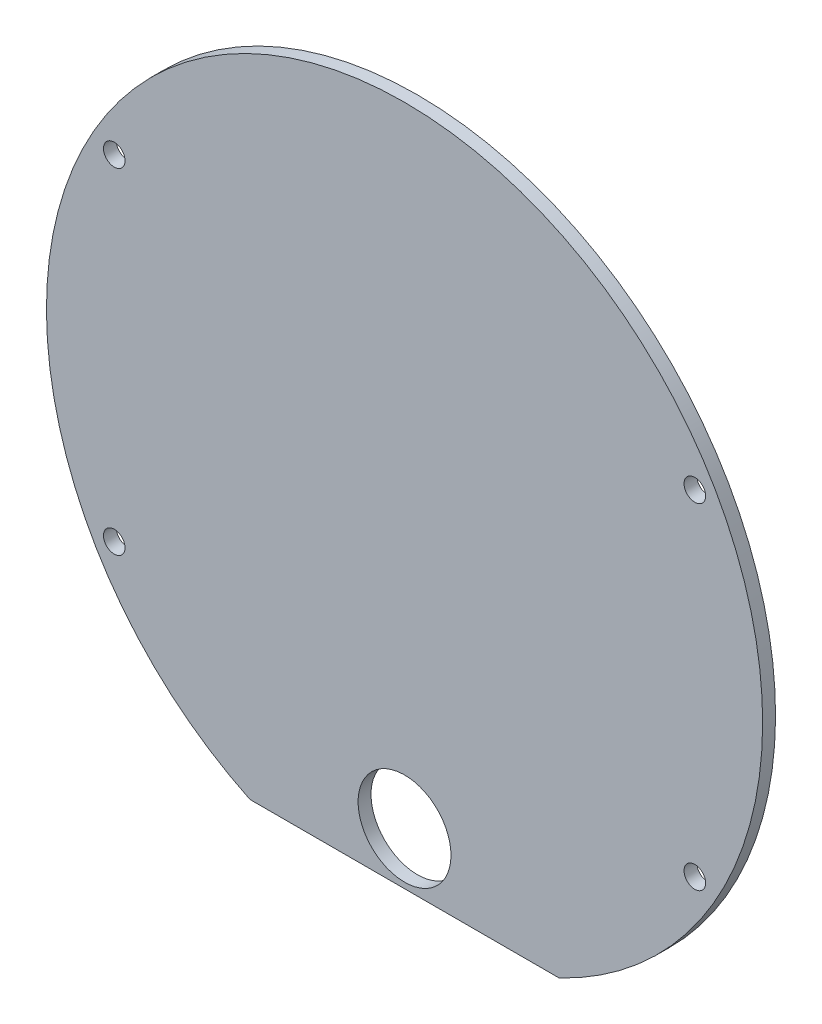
ISO-10303-21;
HEADER;
FILE_DESCRIPTION(('STEP AP214'),'2;1');
FILE_NAME('part.step','',(''),(''),'','','');
FILE_SCHEMA(('AUTOMOTIVE_DESIGN { 1 0 10303 214 1 1 1 1 }'));
ENDSEC;
DATA;
#1=APPLICATION_CONTEXT('core data for automotive mechanical design processes');
#2=APPLICATION_PROTOCOL_DEFINITION('international standard','automotive_design',2000,#1);
#3=PRODUCT_CONTEXT('',#1,'mechanical');
#4=PRODUCT('Part','Part','',(#3));
#5=PRODUCT_RELATED_PRODUCT_CATEGORY('part','',(#4));
#6=PRODUCT_DEFINITION_FORMATION('','',#4);
#7=PRODUCT_DEFINITION_CONTEXT('part definition',#1,'design');
#8=PRODUCT_DEFINITION('design','',#6,#7);
#9=PRODUCT_DEFINITION_SHAPE('','',#8);
#10=(LENGTH_UNIT() NAMED_UNIT(*) SI_UNIT(.MILLI.,.METRE.));
#11=(NAMED_UNIT(*) PLANE_ANGLE_UNIT() SI_UNIT($,.RADIAN.));
#12=(NAMED_UNIT(*) SI_UNIT($,.STERADIAN.) SOLID_ANGLE_UNIT());
#13=UNCERTAINTY_MEASURE_WITH_UNIT(LENGTH_MEASURE(1.E-05),#10,'distance_accuracy_value','');
#14=(GEOMETRIC_REPRESENTATION_CONTEXT(3) GLOBAL_UNCERTAINTY_ASSIGNED_CONTEXT((#13)) GLOBAL_UNIT_ASSIGNED_CONTEXT((#10,
#11,#12)) REPRESENTATION_CONTEXT('',''));
#15=CARTESIAN_POINT('',(0.,0.,0.));
#16=DIRECTION('',(0.,0.,1.));
#17=DIRECTION('',(1.,0.,0.));
#18=AXIS2_PLACEMENT_3D('',#15,#16,#17);
#19=CARTESIAN_POINT('',(0.,0.,3.175));
#20=DIRECTION('',(0.,0.,-1.));
#21=DIRECTION('',(-1.,0.,0.));
#22=AXIS2_PLACEMENT_3D('',#19,#20,#21);
#23=PLANE('',#22);
#24=CARTESIAN_POINT('',(0.,0.,3.175));
#25=DIRECTION('',(0.,0.,-1.));
#26=DIRECTION('',(-1.,0.,0.));
#27=AXIS2_PLACEMENT_3D('',#24,#25,#26);
#28=CIRCLE('',#27,88.138);
#29=CARTESIAN_POINT('',(-38.0491660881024,-79.502,3.175));
#30=VERTEX_POINT('',#29);
#31=CARTESIAN_POINT('',(38.0491660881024,-79.502,3.175));
#32=VERTEX_POINT('',#31);
#33=EDGE_CURVE('E41',#30,#32,#28,.T.);
#34=ORIENTED_EDGE('',*,*,#33,.F.);
#35=DIRECTION('',(1.,0.,0.));
#36=VECTOR('',#35,1.);
#37=CARTESIAN_POINT('',(-38.0491660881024,-79.502,3.175));
#38=LINE('',#37,#36);
#39=EDGE_CURVE('E50',#30,#32,#38,.T.);
#40=ORIENTED_EDGE('',*,*,#39,.T.);
#41=EDGE_LOOP('',(#34,#40));
#42=FACE_BOUND('',#41,.T.);
#43=CARTESIAN_POINT('',(71.4464029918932,-41.2495999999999,3.175));
#44=DIRECTION('',(0.,0.,1.));
#45=DIRECTION('',(1.,0.,0.));
#46=AXIS2_PLACEMENT_3D('',#43,#44,#45);
#47=CIRCLE('',#46,2.6543);
#48=CARTESIAN_POINT('',(74.1007029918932,-41.2495999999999,3.175));
#49=VERTEX_POINT('',#48);
#50=EDGE_CURVE('E53',#49,#49,#47,.F.);
#51=ORIENTED_EDGE('',*,*,#50,.T.);
#52=EDGE_LOOP('',(#51));
#53=FACE_BOUND('',#52,.T.);
#54=CARTESIAN_POINT('',(71.4464029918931,41.2496000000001,3.175));
#55=DIRECTION('',(0.,0.,1.));
#56=DIRECTION('',(1.,0.,0.));
#57=AXIS2_PLACEMENT_3D('',#54,#55,#56);
#58=CIRCLE('',#57,2.6543);
#59=CARTESIAN_POINT('',(74.1007029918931,41.2496000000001,3.175));
#60=VERTEX_POINT('',#59);
#61=EDGE_CURVE('E76',#60,#60,#58,.F.);
#62=ORIENTED_EDGE('',*,*,#61,.T.);
#63=EDGE_LOOP('',(#62));
#64=FACE_BOUND('',#63,.T.);
#65=CARTESIAN_POINT('',(-71.4464029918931,41.2496000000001,3.175));
#66=DIRECTION('',(0.,0.,1.));
#67=DIRECTION('',(1.,0.,0.));
#68=AXIS2_PLACEMENT_3D('',#65,#66,#67);
#69=CIRCLE('',#68,2.6543);
#70=CARTESIAN_POINT('',(-68.7921029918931,41.2496000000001,3.175));
#71=VERTEX_POINT('',#70);
#72=EDGE_CURVE('E79',#71,#71,#69,.F.);
#73=ORIENTED_EDGE('',*,*,#72,.T.);
#74=EDGE_LOOP('',(#73));
#75=FACE_BOUND('',#74,.T.);
#76=CARTESIAN_POINT('',(-71.4464029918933,-41.2495999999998,3.175));
#77=DIRECTION('',(0.,0.,1.));
#78=DIRECTION('',(1.,0.,0.));
#79=AXIS2_PLACEMENT_3D('',#76,#77,#78);
#80=CIRCLE('',#79,2.6543);
#81=CARTESIAN_POINT('',(-68.7921029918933,-41.2495999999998,3.175));
#82=VERTEX_POINT('',#81);
#83=EDGE_CURVE('E81',#82,#82,#80,.F.);
#84=ORIENTED_EDGE('',*,*,#83,.T.);
#85=EDGE_LOOP('',(#84));
#86=FACE_BOUND('',#85,.T.);
#87=CARTESIAN_POINT('',(0.,-66.675,3.175));
#88=DIRECTION('',(0.,0.,1.));
#89=DIRECTION('',(1.,0.,0.));
#90=AXIS2_PLACEMENT_3D('',#87,#88,#89);
#91=CIRCLE('',#90,11.43);
#92=CARTESIAN_POINT('',(11.43,-66.675,3.175));
#93=VERTEX_POINT('',#92);
#94=EDGE_CURVE('E19',#93,#93,#91,.F.);
#95=ORIENTED_EDGE('',*,*,#94,.T.);
#96=EDGE_LOOP('',(#95));
#97=FACE_BOUND('',#96,.T.);
#98=ADVANCED_FACE('F16',(#42,#53,#64,#75,#86,#97),#23,.F.);
#99=CARTESIAN_POINT('',(0.,-66.675,-0.00100000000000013));
#100=DIRECTION('',(0.,0.,1.));
#101=DIRECTION('',(1.,0.,0.));
#102=AXIS2_PLACEMENT_3D('',#99,#100,#101);
#103=CYLINDRICAL_SURFACE('',#102,11.43);
#104=ORIENTED_EDGE('',*,*,#94,.F.);
#105=EDGE_LOOP('',(#104));
#106=FACE_BOUND('',#105,.T.);
#107=CARTESIAN_POINT('',(0.,-66.675,0.));
#108=DIRECTION('',(0.,0.,1.));
#109=DIRECTION('',(1.,0.,0.));
#110=AXIS2_PLACEMENT_3D('',#107,#108,#109);
#111=CIRCLE('',#110,11.43);
#112=CARTESIAN_POINT('',(11.43,-66.675,0.));
#113=VERTEX_POINT('',#112);
#114=EDGE_CURVE('E48',#113,#113,#111,.T.);
#115=ORIENTED_EDGE('',*,*,#114,.F.);
#116=EDGE_LOOP('',(#115));
#117=FACE_BOUND('',#116,.T.);
#118=ADVANCED_FACE('F89',(#106,#117),#103,.F.);
#119=CARTESIAN_POINT('',(-71.4464029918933,-41.2495999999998,3.175));
#120=DIRECTION('',(0.,0.,1.));
#121=DIRECTION('',(1.,0.,0.));
#122=AXIS2_PLACEMENT_3D('',#119,#120,#121);
#123=CYLINDRICAL_SURFACE('',#122,2.6543);
#124=CARTESIAN_POINT('',(-71.4464029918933,-41.2495999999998,0.));
#125=DIRECTION('',(0.,0.,1.));
#126=DIRECTION('',(1.,0.,0.));
#127=AXIS2_PLACEMENT_3D('',#124,#125,#126);
#128=CIRCLE('',#127,2.6543);
#129=CARTESIAN_POINT('',(-68.7921029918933,-41.2495999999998,0.));
#130=VERTEX_POINT('',#129);
#131=EDGE_CURVE('E69',#130,#130,#128,.T.);
#132=ORIENTED_EDGE('',*,*,#131,.F.);
#133=EDGE_LOOP('',(#132));
#134=FACE_BOUND('',#133,.T.);
#135=ORIENTED_EDGE('',*,*,#83,.F.);
#136=EDGE_LOOP('',(#135));
#137=FACE_BOUND('',#136,.T.);
#138=ADVANCED_FACE('F92',(#134,#137),#123,.F.);
#139=CARTESIAN_POINT('',(-71.4464029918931,41.2496000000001,3.175));
#140=DIRECTION('',(0.,0.,1.));
#141=DIRECTION('',(1.,0.,0.));
#142=AXIS2_PLACEMENT_3D('',#139,#140,#141);
#143=CYLINDRICAL_SURFACE('',#142,2.6543);
#144=CARTESIAN_POINT('',(-71.4464029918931,41.2496000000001,0.));
#145=DIRECTION('',(0.,0.,1.));
#146=DIRECTION('',(1.,0.,0.));
#147=AXIS2_PLACEMENT_3D('',#144,#145,#146);
#148=CIRCLE('',#147,2.6543);
#149=CARTESIAN_POINT('',(-68.7921029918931,41.2496000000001,0.));
#150=VERTEX_POINT('',#149);
#151=EDGE_CURVE('E66',#150,#150,#148,.T.);
#152=ORIENTED_EDGE('',*,*,#151,.F.);
#153=EDGE_LOOP('',(#152));
#154=FACE_BOUND('',#153,.T.);
#155=ORIENTED_EDGE('',*,*,#72,.F.);
#156=EDGE_LOOP('',(#155));
#157=FACE_BOUND('',#156,.T.);
#158=ADVANCED_FACE('F115',(#154,#157),#143,.F.);
#159=CARTESIAN_POINT('',(71.4464029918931,41.2496000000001,3.175));
#160=DIRECTION('',(0.,0.,1.));
#161=DIRECTION('',(1.,0.,0.));
#162=AXIS2_PLACEMENT_3D('',#159,#160,#161);
#163=CYLINDRICAL_SURFACE('',#162,2.6543);
#164=CARTESIAN_POINT('',(71.4464029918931,41.2496000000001,0.));
#165=DIRECTION('',(0.,0.,1.));
#166=DIRECTION('',(1.,0.,0.));
#167=AXIS2_PLACEMENT_3D('',#164,#165,#166);
#168=CIRCLE('',#167,2.6543);
#169=CARTESIAN_POINT('',(74.1007029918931,41.2496000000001,0.));
#170=VERTEX_POINT('',#169);
#171=EDGE_CURVE('E63',#170,#170,#168,.T.);
#172=ORIENTED_EDGE('',*,*,#171,.F.);
#173=EDGE_LOOP('',(#172));
#174=FACE_BOUND('',#173,.T.);
#175=ORIENTED_EDGE('',*,*,#61,.F.);
#176=EDGE_LOOP('',(#175));
#177=FACE_BOUND('',#176,.T.);
#178=ADVANCED_FACE('F111',(#174,#177),#163,.F.);
#179=CARTESIAN_POINT('',(71.4464029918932,-41.2495999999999,3.175));
#180=DIRECTION('',(0.,0.,1.));
#181=DIRECTION('',(1.,0.,0.));
#182=AXIS2_PLACEMENT_3D('',#179,#180,#181);
#183=CYLINDRICAL_SURFACE('',#182,2.6543);
#184=CARTESIAN_POINT('',(71.4464029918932,-41.2495999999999,0.));
#185=DIRECTION('',(0.,0.,1.));
#186=DIRECTION('',(1.,0.,0.));
#187=AXIS2_PLACEMENT_3D('',#184,#185,#186);
#188=CIRCLE('',#187,2.6543);
#189=CARTESIAN_POINT('',(74.1007029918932,-41.2495999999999,0.));
#190=VERTEX_POINT('',#189);
#191=EDGE_CURVE('E60',#190,#190,#188,.T.);
#192=ORIENTED_EDGE('',*,*,#191,.F.);
#193=EDGE_LOOP('',(#192));
#194=FACE_BOUND('',#193,.T.);
#195=ORIENTED_EDGE('',*,*,#50,.F.);
#196=EDGE_LOOP('',(#195));
#197=FACE_BOUND('',#196,.T.);
#198=ADVANCED_FACE('F108',(#194,#197),#183,.F.);
#199=CARTESIAN_POINT('',(-38.0491660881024,-79.502,3.175));
#200=DIRECTION('',(0.,1.,0.));
#201=DIRECTION('',(0.,0.,1.));
#202=AXIS2_PLACEMENT_3D('',#199,#200,#201);
#203=PLANE('',#202);
#204=DIRECTION('',(0.,0.,1.));
#205=VECTOR('',#204,1.);
#206=CARTESIAN_POINT('',(38.0491660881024,-79.502,3.175));
#207=LINE('',#206,#205);
#208=CARTESIAN_POINT('',(38.0491660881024,-79.502,0.));
#209=VERTEX_POINT('',#208);
#210=EDGE_CURVE('E45',#32,#209,#207,.F.);
#211=ORIENTED_EDGE('',*,*,#210,.F.);
#212=ORIENTED_EDGE('',*,*,#39,.F.);
#213=DIRECTION('',(0.,0.,-1.));
#214=VECTOR('',#213,1.);
#215=CARTESIAN_POINT('',(-38.0491660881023,-79.502,3.175));
#216=LINE('',#215,#214);
#217=CARTESIAN_POINT('',(-38.0491660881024,-79.502,0.));
#218=VERTEX_POINT('',#217);
#219=EDGE_CURVE('E47',#218,#30,#216,.F.);
#220=ORIENTED_EDGE('',*,*,#219,.F.);
#221=DIRECTION('',(-1.,0.,0.));
#222=VECTOR('',#221,1.);
#223=CARTESIAN_POINT('',(0.,-79.502,0.));
#224=LINE('',#223,#222);
#225=EDGE_CURVE('E11',#209,#218,#224,.T.);
#226=ORIENTED_EDGE('',*,*,#225,.F.);
#227=EDGE_LOOP('',(#211,#212,#220,#226));
#228=FACE_BOUND('',#227,.T.);
#229=ADVANCED_FACE('F55',(#228),#203,.F.);
#230=CARTESIAN_POINT('',(0.,0.,3.175));
#231=DIRECTION('',(0.,0.,-1.));
#232=DIRECTION('',(-1.,0.,0.));
#233=AXIS2_PLACEMENT_3D('',#230,#231,#232);
#234=CYLINDRICAL_SURFACE('',#233,88.138);
#235=CARTESIAN_POINT('',(0.,0.,0.));
#236=DIRECTION('',(0.,0.,-1.));
#237=DIRECTION('',(-1.,0.,0.));
#238=AXIS2_PLACEMENT_3D('',#235,#236,#237);
#239=CIRCLE('',#238,88.138);
#240=EDGE_CURVE('E25',#218,#209,#239,.T.);
#241=ORIENTED_EDGE('',*,*,#240,.F.);
#242=ORIENTED_EDGE('',*,*,#219,.T.);
#243=ORIENTED_EDGE('',*,*,#33,.T.);
#244=ORIENTED_EDGE('',*,*,#210,.T.);
#245=EDGE_LOOP('',(#241,#242,#243,#244));
#246=FACE_BOUND('',#245,.T.);
#247=ADVANCED_FACE('F43',(#246),#234,.T.);
#248=CARTESIAN_POINT('',(0.,0.,0.));
#249=DIRECTION('',(0.,0.,-1.));
#250=DIRECTION('',(-1.,0.,0.));
#251=AXIS2_PLACEMENT_3D('',#248,#249,#250);
#252=PLANE('',#251);
#253=ORIENTED_EDGE('',*,*,#225,.T.);
#254=ORIENTED_EDGE('',*,*,#240,.T.);
#255=EDGE_LOOP('',(#253,#254));
#256=FACE_BOUND('',#255,.T.);
#257=ORIENTED_EDGE('',*,*,#191,.T.);
#258=EDGE_LOOP('',(#257));
#259=FACE_BOUND('',#258,.T.);
#260=ORIENTED_EDGE('',*,*,#171,.T.);
#261=EDGE_LOOP('',(#260));
#262=FACE_BOUND('',#261,.T.);
#263=ORIENTED_EDGE('',*,*,#151,.T.);
#264=EDGE_LOOP('',(#263));
#265=FACE_BOUND('',#264,.T.);
#266=ORIENTED_EDGE('',*,*,#131,.T.);
#267=EDGE_LOOP('',(#266));
#268=FACE_BOUND('',#267,.T.);
#269=ORIENTED_EDGE('',*,*,#114,.T.);
#270=EDGE_LOOP('',(#269));
#271=FACE_BOUND('',#270,.T.);
#272=ADVANCED_FACE('F95',(#256,#259,#262,#265,#268,#271),#252,.T.);
#273=CLOSED_SHELL('',(#98,#118,#138,#158,#178,#198,#229,#247,#272));
#274=MANIFOLD_SOLID_BREP('B1',#273);
#275=ADVANCED_BREP_SHAPE_REPRESENTATION('',(#18,#274),#14);
#276=SHAPE_DEFINITION_REPRESENTATION(#9,#275);
ENDSEC;
END-ISO-10303-21;
